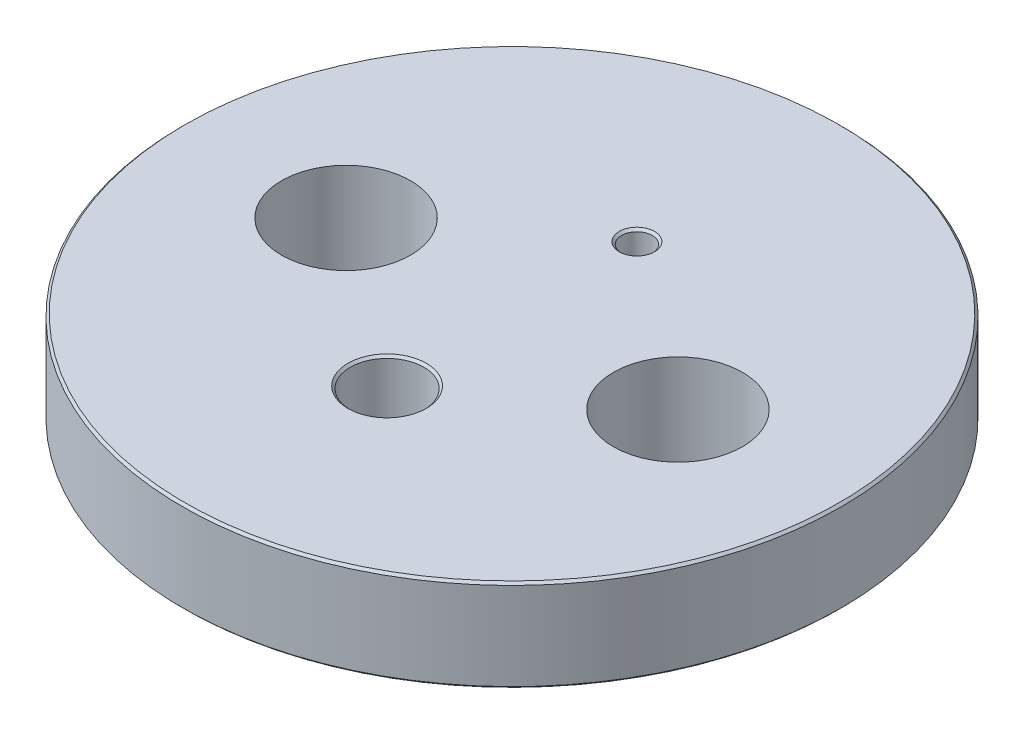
ISO-10303-21;
HEADER;
FILE_DESCRIPTION(('STEP AP214'),'2;1');
FILE_NAME('part.step','',(''),(''),'','','');
FILE_SCHEMA(('AUTOMOTIVE_DESIGN { 1 0 10303 214 1 1 1 1 }'));
ENDSEC;
DATA;
#1=APPLICATION_CONTEXT('core data for automotive mechanical design processes');
#2=APPLICATION_PROTOCOL_DEFINITION('international standard','automotive_design',2000,#1);
#3=PRODUCT_CONTEXT('',#1,'mechanical');
#4=PRODUCT('Part','Part','',(#3));
#5=PRODUCT_RELATED_PRODUCT_CATEGORY('part','',(#4));
#6=PRODUCT_DEFINITION_FORMATION('','',#4);
#7=PRODUCT_DEFINITION_CONTEXT('part definition',#1,'design');
#8=PRODUCT_DEFINITION('design','',#6,#7);
#9=PRODUCT_DEFINITION_SHAPE('','',#8);
#10=(LENGTH_UNIT() NAMED_UNIT(*) SI_UNIT(.MILLI.,.METRE.));
#11=(NAMED_UNIT(*) PLANE_ANGLE_UNIT() SI_UNIT($,.RADIAN.));
#12=(NAMED_UNIT(*) SI_UNIT($,.STERADIAN.) SOLID_ANGLE_UNIT());
#13=UNCERTAINTY_MEASURE_WITH_UNIT(LENGTH_MEASURE(1.E-05),#10,'distance_accuracy_value','');
#14=(GEOMETRIC_REPRESENTATION_CONTEXT(3) GLOBAL_UNCERTAINTY_ASSIGNED_CONTEXT((#13)) GLOBAL_UNIT_ASSIGNED_CONTEXT((#10,
#11,#12)) REPRESENTATION_CONTEXT('',''));
#15=CARTESIAN_POINT('',(0.,0.,0.));
#16=DIRECTION('',(0.,0.,1.));
#17=DIRECTION('',(1.,0.,0.));
#18=AXIS2_PLACEMENT_3D('',#15,#16,#17);
#19=CARTESIAN_POINT('',(0.,-32.5,13.55));
#20=DIRECTION('',(0.,1.,0.));
#21=DIRECTION('',(1.,0.,0.));
#22=AXIS2_PLACEMENT_3D('',#19,#20,#21);
#23=CYLINDRICAL_SURFACE('',#22,4.);
#24=CARTESIAN_POINT('',(0.,-22.75,13.55));
#25=DIRECTION('',(0.,-1.,0.));
#26=DIRECTION('',(1.,0.,0.));
#27=AXIS2_PLACEMENT_3D('',#24,#25,#26);
#28=CIRCLE('',#27,4.);
#29=CARTESIAN_POINT('',(4.,-22.75,13.55));
#30=VERTEX_POINT('',#29);
#31=EDGE_CURVE('E126',#30,#30,#28,.T.);
#32=ORIENTED_EDGE('',*,*,#31,.F.);
#33=DIRECTION('',(0.,1.,0.));
#34=VECTOR('',#33,1.);
#35=CARTESIAN_POINT('',(4.,-32.5,13.55));
#36=LINE('',#35,#34);
#37=CARTESIAN_POINT('',(4.,-32.25,13.55));
#38=VERTEX_POINT('',#37);
#39=EDGE_CURVE('E10',#38,#30,#36,.T.);
#40=ORIENTED_EDGE('',*,*,#39,.F.);
#41=CARTESIAN_POINT('',(0.,-32.25,13.55));
#42=DIRECTION('',(0.,1.,0.));
#43=DIRECTION('',(1.,0.,0.));
#44=AXIS2_PLACEMENT_3D('',#41,#42,#43);
#45=CIRCLE('',#44,4.);
#46=EDGE_CURVE('E175',#38,#38,#45,.T.);
#47=ORIENTED_EDGE('',*,*,#46,.F.);
#48=ORIENTED_EDGE('',*,*,#39,.T.);
#49=EDGE_LOOP('',(#32,#40,#47,#48));
#50=FACE_BOUND('',#49,.T.);
#51=ADVANCED_FACE('F16',(#50),#23,.F.);
#52=CARTESIAN_POINT('',(0.,-22.5,0.));
#53=DIRECTION('',(0.,-1.,0.));
#54=DIRECTION('',(-1.,0.,0.));
#55=AXIS2_PLACEMENT_3D('',#52,#53,#54);
#56=CYLINDRICAL_SURFACE('',#55,35.75);
#57=CARTESIAN_POINT('',(0.,-22.75,0.));
#58=DIRECTION('',(0.,1.,0.));
#59=DIRECTION('',(-1.,0.,0.));
#60=AXIS2_PLACEMENT_3D('',#57,#58,#59);
#61=CIRCLE('',#60,35.75);
#62=CARTESIAN_POINT('',(-35.75,-22.75,0.));
#63=VERTEX_POINT('',#62);
#64=EDGE_CURVE('E140',#63,#63,#61,.T.);
#65=ORIENTED_EDGE('',*,*,#64,.F.);
#66=DIRECTION('',(0.,-1.,0.));
#67=VECTOR('',#66,1.);
#68=CARTESIAN_POINT('',(-35.75,-22.5,0.));
#69=LINE('',#68,#67);
#70=CARTESIAN_POINT('',(-35.75,-32.25,0.));
#71=VERTEX_POINT('',#70);
#72=EDGE_CURVE('E24',#63,#71,#69,.T.);
#73=ORIENTED_EDGE('',*,*,#72,.T.);
#74=CARTESIAN_POINT('',(0.,-32.25,0.));
#75=DIRECTION('',(0.,-1.,0.));
#76=DIRECTION('',(-1.,0.,0.));
#77=AXIS2_PLACEMENT_3D('',#74,#75,#76);
#78=CIRCLE('',#77,35.75);
#79=EDGE_CURVE('E164',#71,#71,#78,.T.);
#80=ORIENTED_EDGE('',*,*,#79,.F.);
#81=ORIENTED_EDGE('',*,*,#72,.F.);
#82=EDGE_LOOP('',(#65,#73,#80,#81));
#83=FACE_BOUND('',#82,.T.);
#84=ADVANCED_FACE('F263',(#83),#56,.T.);
#85=CARTESIAN_POINT('',(0.,-32.375,13.55));
#86=DIRECTION('',(0.,-1.,0.));
#87=DIRECTION('',(1.,0.,0.));
#88=AXIS2_PLACEMENT_3D('',#85,#86,#87);
#89=CONICAL_SURFACE('',#88,4.125,0.785398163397);
#90=CARTESIAN_POINT('',(0.,-32.5,13.55));
#91=DIRECTION('',(0.,1.,0.));
#92=DIRECTION('',(1.,0.,0.));
#93=AXIS2_PLACEMENT_3D('',#90,#91,#92);
#94=CIRCLE('',#93,4.25);
#95=CARTESIAN_POINT('',(4.25,-32.5,13.55));
#96=VERTEX_POINT('',#95);
#97=EDGE_CURVE('E133',#96,#96,#94,.T.);
#98=ORIENTED_EDGE('',*,*,#97,.F.);
#99=DIRECTION('',(0.707106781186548,-0.707106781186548,0.));
#100=VECTOR('',#99,1.);
#101=CARTESIAN_POINT('',(4.125,-32.375,13.55));
#102=LINE('',#101,#100);
#103=EDGE_CURVE('E110',#38,#96,#102,.T.);
#104=ORIENTED_EDGE('',*,*,#103,.F.);
#105=ORIENTED_EDGE('',*,*,#46,.T.);
#106=ORIENTED_EDGE('',*,*,#103,.T.);
#107=EDGE_LOOP('',(#98,#104,#105,#106));
#108=FACE_BOUND('',#107,.T.);
#109=ADVANCED_FACE('F228',(#108),#89,.F.);
#110=CARTESIAN_POINT('',(0.,-32.375,0.));
#111=DIRECTION('',(0.,1.,0.));
#112=DIRECTION('',(-1.,0.,0.));
#113=AXIS2_PLACEMENT_3D('',#110,#111,#112);
#114=CONICAL_SURFACE('',#113,35.625,0.785398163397);
#115=CARTESIAN_POINT('',(0.,-32.5,0.));
#116=DIRECTION('',(0.,-1.,0.));
#117=DIRECTION('',(-1.,0.,0.));
#118=AXIS2_PLACEMENT_3D('',#115,#116,#117);
#119=CIRCLE('',#118,35.5);
#120=CARTESIAN_POINT('',(-35.5,-32.5,0.));
#121=VERTEX_POINT('',#120);
#122=EDGE_CURVE('E159',#121,#121,#119,.T.);
#123=ORIENTED_EDGE('',*,*,#122,.F.);
#124=DIRECTION('',(-0.707106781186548,0.707106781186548,0.));
#125=VECTOR('',#124,1.);
#126=CARTESIAN_POINT('',(-35.625,-32.375,0.));
#127=LINE('',#126,#125);
#128=EDGE_CURVE('E125',#121,#71,#127,.T.);
#129=ORIENTED_EDGE('',*,*,#128,.T.);
#130=ORIENTED_EDGE('',*,*,#79,.T.);
#131=ORIENTED_EDGE('',*,*,#128,.F.);
#132=EDGE_LOOP('',(#123,#129,#130,#131));
#133=FACE_BOUND('',#132,.T.);
#134=ADVANCED_FACE('F319',(#133),#114,.T.);
#135=CARTESIAN_POINT('',(18.,-32.6,0.));
#136=DIRECTION('',(0.,1.,0.));
#137=DIRECTION('',(0.,0.,1.));
#138=AXIS2_PLACEMENT_3D('',#135,#136,#137);
#139=CYLINDRICAL_SURFACE('',#138,7.);
#140=DIRECTION('',(0.,1.,0.));
#141=VECTOR('',#140,1.);
#142=CARTESIAN_POINT('',(18.,-32.6,7.));
#143=LINE('',#142,#141);
#144=CARTESIAN_POINT('',(18.,-32.5,7.));
#145=VERTEX_POINT('',#144);
#146=CARTESIAN_POINT('',(18.,-22.5,7.));
#147=VERTEX_POINT('',#146);
#148=EDGE_CURVE('E118',#145,#147,#143,.T.);
#149=ORIENTED_EDGE('',*,*,#148,.F.);
#150=CARTESIAN_POINT('',(18.,-32.5,0.));
#151=DIRECTION('',(0.,1.,0.));
#152=DIRECTION('',(0.,0.,1.));
#153=AXIS2_PLACEMENT_3D('',#150,#151,#152);
#154=CIRCLE('',#153,7.);
#155=EDGE_CURVE('E121',#145,#145,#154,.T.);
#156=ORIENTED_EDGE('',*,*,#155,.F.);
#157=ORIENTED_EDGE('',*,*,#148,.T.);
#158=CARTESIAN_POINT('',(18.,-22.5,0.));
#159=DIRECTION('',(0.,1.,0.));
#160=DIRECTION('',(0.,0.,1.));
#161=AXIS2_PLACEMENT_3D('',#158,#159,#160);
#162=CIRCLE('',#161,7.);
#163=EDGE_CURVE('E123',#147,#147,#162,.T.);
#164=ORIENTED_EDGE('',*,*,#163,.T.);
#165=EDGE_LOOP('',(#149,#156,#157,#164));
#166=FACE_BOUND('',#165,.T.);
#167=ADVANCED_FACE('F120',(#166),#139,.F.);
#168=CARTESIAN_POINT('',(0.,-22.625,13.55));
#169=DIRECTION('',(0.,1.,0.));
#170=DIRECTION('',(1.,0.,0.));
#171=AXIS2_PLACEMENT_3D('',#168,#169,#170);
#172=CONICAL_SURFACE('',#171,4.125,0.785398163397);
#173=CARTESIAN_POINT('',(0.,-22.5,13.55));
#174=DIRECTION('',(0.,-1.,0.));
#175=DIRECTION('',(1.,0.,0.));
#176=AXIS2_PLACEMENT_3D('',#173,#174,#175);
#177=CIRCLE('',#176,4.25);
#178=CARTESIAN_POINT('',(4.25,-22.5,13.55));
#179=VERTEX_POINT('',#178);
#180=EDGE_CURVE('E160',#179,#179,#177,.T.);
#181=ORIENTED_EDGE('',*,*,#180,.F.);
#182=DIRECTION('',(0.707106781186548,0.707106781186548,0.));
#183=VECTOR('',#182,1.);
#184=CARTESIAN_POINT('',(4.125,-22.625,13.55));
#185=LINE('',#184,#183);
#186=EDGE_CURVE('E210',#30,#179,#185,.T.);
#187=ORIENTED_EDGE('',*,*,#186,.F.);
#188=ORIENTED_EDGE('',*,*,#31,.T.);
#189=ORIENTED_EDGE('',*,*,#186,.T.);
#190=EDGE_LOOP('',(#181,#187,#188,#189));
#191=FACE_BOUND('',#190,.T.);
#192=ADVANCED_FACE('F226',(#191),#172,.F.);
#193=CARTESIAN_POINT('',(-18.,-32.6,0.));
#194=DIRECTION('',(0.,1.,0.));
#195=DIRECTION('',(0.,0.,1.));
#196=AXIS2_PLACEMENT_3D('',#193,#194,#195);
#197=CYLINDRICAL_SURFACE('',#196,7.);
#198=DIRECTION('',(0.,1.,0.));
#199=VECTOR('',#198,1.);
#200=CARTESIAN_POINT('',(-18.,-32.6,7.));
#201=LINE('',#200,#199);
#202=CARTESIAN_POINT('',(-18.,-32.5,7.));
#203=VERTEX_POINT('',#202);
#204=CARTESIAN_POINT('',(-18.,-22.5,7.));
#205=VERTEX_POINT('',#204);
#206=EDGE_CURVE('E147',#203,#205,#201,.T.);
#207=ORIENTED_EDGE('',*,*,#206,.F.);
#208=CARTESIAN_POINT('',(-18.,-32.5,0.));
#209=DIRECTION('',(0.,1.,0.));
#210=DIRECTION('',(0.,0.,1.));
#211=AXIS2_PLACEMENT_3D('',#208,#209,#210);
#212=CIRCLE('',#211,7.);
#213=EDGE_CURVE('E143',#203,#203,#212,.T.);
#214=ORIENTED_EDGE('',*,*,#213,.F.);
#215=ORIENTED_EDGE('',*,*,#206,.T.);
#216=CARTESIAN_POINT('',(-18.,-22.5,0.));
#217=DIRECTION('',(0.,1.,0.));
#218=DIRECTION('',(0.,0.,1.));
#219=AXIS2_PLACEMENT_3D('',#216,#217,#218);
#220=CIRCLE('',#219,7.);
#221=EDGE_CURVE('E155',#205,#205,#220,.T.);
#222=ORIENTED_EDGE('',*,*,#221,.T.);
#223=EDGE_LOOP('',(#207,#214,#215,#222));
#224=FACE_BOUND('',#223,.T.);
#225=ADVANCED_FACE('F285',(#224),#197,.F.);
#226=CARTESIAN_POINT('',(0.,-22.625,0.));
#227=DIRECTION('',(0.,-1.,0.));
#228=DIRECTION('',(-1.,0.,0.));
#229=AXIS2_PLACEMENT_3D('',#226,#227,#228);
#230=CONICAL_SURFACE('',#229,35.625,0.785398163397);
#231=CARTESIAN_POINT('',(0.,-22.5,0.));
#232=DIRECTION('',(0.,1.,0.));
#233=DIRECTION('',(-1.,0.,0.));
#234=AXIS2_PLACEMENT_3D('',#231,#232,#233);
#235=CIRCLE('',#234,35.5);
#236=CARTESIAN_POINT('',(-35.5,-22.5,0.));
#237=VERTEX_POINT('',#236);
#238=EDGE_CURVE('E151',#237,#237,#235,.T.);
#239=ORIENTED_EDGE('',*,*,#238,.F.);
#240=DIRECTION('',(-0.707106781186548,-0.707106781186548,0.));
#241=VECTOR('',#240,1.);
#242=CARTESIAN_POINT('',(-35.625,-22.625,0.));
#243=LINE('',#242,#241);
#244=EDGE_CURVE('E132',#237,#63,#243,.T.);
#245=ORIENTED_EDGE('',*,*,#244,.T.);
#246=ORIENTED_EDGE('',*,*,#64,.T.);
#247=ORIENTED_EDGE('',*,*,#244,.F.);
#248=EDGE_LOOP('',(#239,#245,#246,#247));
#249=FACE_BOUND('',#248,.T.);
#250=ADVANCED_FACE('F292',(#249),#230,.T.);
#251=CARTESIAN_POINT('',(0.,-32.5,0.));
#252=DIRECTION('',(0.,-1.,0.));
#253=DIRECTION('',(-1.,0.,0.));
#254=AXIS2_PLACEMENT_3D('',#251,#252,#253);
#255=PLANE('',#254);
#256=ORIENTED_EDGE('',*,*,#155,.T.);
#257=EDGE_LOOP('',(#256));
#258=FACE_BOUND('',#257,.T.);
#259=CARTESIAN_POINT('',(0.,-32.5,-13.55));
#260=DIRECTION('',(0.,-1.,0.));
#261=DIRECTION('',(1.,0.,0.));
#262=AXIS2_PLACEMENT_3D('',#259,#260,#261);
#263=CIRCLE('',#262,4.25);
#264=CARTESIAN_POINT('',(4.25,-32.5,-13.55));
#265=VERTEX_POINT('',#264);
#266=EDGE_CURVE('E156',#265,#265,#263,.T.);
#267=ORIENTED_EDGE('',*,*,#266,.F.);
#268=EDGE_LOOP('',(#267));
#269=FACE_BOUND('',#268,.T.);
#270=ORIENTED_EDGE('',*,*,#97,.T.);
#271=EDGE_LOOP('',(#270));
#272=FACE_BOUND('',#271,.T.);
#273=ORIENTED_EDGE('',*,*,#213,.T.);
#274=EDGE_LOOP('',(#273));
#275=FACE_BOUND('',#274,.T.);
#276=ORIENTED_EDGE('',*,*,#122,.T.);
#277=EDGE_LOOP('',(#276));
#278=FACE_BOUND('',#277,.T.);
#279=ADVANCED_FACE('F129',(#258,#269,#272,#275,#278),#255,.T.);
#280=CARTESIAN_POINT('',(0.,-22.5,0.));
#281=DIRECTION('',(0.,-1.,0.));
#282=DIRECTION('',(-1.,0.,0.));
#283=AXIS2_PLACEMENT_3D('',#280,#281,#282);
#284=PLANE('',#283);
#285=ORIENTED_EDGE('',*,*,#163,.F.);
#286=EDGE_LOOP('',(#285));
#287=FACE_BOUND('',#286,.T.);
#288=CARTESIAN_POINT('',(0.,-22.5,-13.55));
#289=DIRECTION('',(0.,1.,0.));
#290=DIRECTION('',(1.,0.,0.));
#291=AXIS2_PLACEMENT_3D('',#288,#289,#290);
#292=CIRCLE('',#291,1.916);
#293=CARTESIAN_POINT('',(1.916,-22.5,-13.55));
#294=VERTEX_POINT('',#293);
#295=EDGE_CURVE('E173',#294,#294,#292,.T.);
#296=ORIENTED_EDGE('',*,*,#295,.F.);
#297=EDGE_LOOP('',(#296));
#298=FACE_BOUND('',#297,.T.);
#299=ORIENTED_EDGE('',*,*,#180,.T.);
#300=EDGE_LOOP('',(#299));
#301=FACE_BOUND('',#300,.T.);
#302=ORIENTED_EDGE('',*,*,#221,.F.);
#303=EDGE_LOOP('',(#302));
#304=FACE_BOUND('',#303,.T.);
#305=ORIENTED_EDGE('',*,*,#238,.T.);
#306=EDGE_LOOP('',(#305));
#307=FACE_BOUND('',#306,.T.);
#308=ADVANCED_FACE('F253',(#287,#298,#301,#304,#307),#284,.F.);
#309=CARTESIAN_POINT('',(0.,-32.375,-13.55));
#310=DIRECTION('',(0.,-1.,0.));
#311=DIRECTION('',(1.,0.,0.));
#312=AXIS2_PLACEMENT_3D('',#309,#310,#311);
#313=CONICAL_SURFACE('',#312,4.125,0.785398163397);
#314=DIRECTION('',(0.707106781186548,-0.707106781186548,0.));
#315=VECTOR('',#314,1.);
#316=CARTESIAN_POINT('',(4.125,-32.375,-13.55));
#317=LINE('',#316,#315);
#318=CARTESIAN_POINT('',(4.,-32.25,-13.55));
#319=VERTEX_POINT('',#318);
#320=EDGE_CURVE('E170',#319,#265,#317,.T.);
#321=ORIENTED_EDGE('',*,*,#320,.F.);
#322=CARTESIAN_POINT('',(0.,-32.25,-13.55));
#323=DIRECTION('',(0.,-1.,0.));
#324=DIRECTION('',(1.,0.,0.));
#325=AXIS2_PLACEMENT_3D('',#322,#323,#324);
#326=CIRCLE('',#325,4.);
#327=EDGE_CURVE('E190',#319,#319,#326,.T.);
#328=ORIENTED_EDGE('',*,*,#327,.F.);
#329=ORIENTED_EDGE('',*,*,#320,.T.);
#330=ORIENTED_EDGE('',*,*,#266,.T.);
#331=EDGE_LOOP('',(#321,#328,#329,#330));
#332=FACE_BOUND('',#331,.T.);
#333=ADVANCED_FACE('F269',(#332),#313,.F.);
#334=CARTESIAN_POINT('',(0.,-22.625,-13.55));
#335=DIRECTION('',(0.,1.,0.));
#336=DIRECTION('',(1.,0.,0.));
#337=AXIS2_PLACEMENT_3D('',#334,#335,#336);
#338=CONICAL_SURFACE('',#337,1.791,0.785398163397);
#339=DIRECTION('',(0.707106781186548,0.707106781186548,0.));
#340=VECTOR('',#339,1.);
#341=CARTESIAN_POINT('',(1.791,-22.625,-13.55));
#342=LINE('',#341,#340);
#343=CARTESIAN_POINT('',(1.666,-22.75,-13.55));
#344=VERTEX_POINT('',#343);
#345=EDGE_CURVE('E193',#344,#294,#342,.T.);
#346=ORIENTED_EDGE('',*,*,#345,.F.);
#347=CARTESIAN_POINT('',(0.,-22.75,-13.55));
#348=DIRECTION('',(0.,1.,0.));
#349=DIRECTION('',(1.,0.,0.));
#350=AXIS2_PLACEMENT_3D('',#347,#348,#349);
#351=CIRCLE('',#350,1.666);
#352=EDGE_CURVE('E219',#344,#344,#351,.T.);
#353=ORIENTED_EDGE('',*,*,#352,.F.);
#354=ORIENTED_EDGE('',*,*,#345,.T.);
#355=ORIENTED_EDGE('',*,*,#295,.T.);
#356=EDGE_LOOP('',(#346,#353,#354,#355));
#357=FACE_BOUND('',#356,.T.);
#358=ADVANCED_FACE('F274',(#357),#338,.F.);
#359=CARTESIAN_POINT('',(0.,-32.5,-13.55));
#360=DIRECTION('',(0.,1.,0.));
#361=DIRECTION('',(1.,0.,0.));
#362=AXIS2_PLACEMENT_3D('',#359,#360,#361);
#363=CYLINDRICAL_SURFACE('',#362,4.);
#364=CARTESIAN_POINT('',(0.,-26.5,-13.55));
#365=DIRECTION('',(0.,-1.,0.));
#366=DIRECTION('',(1.,0.,0.));
#367=AXIS2_PLACEMENT_3D('',#364,#365,#366);
#368=CIRCLE('',#367,4.);
#369=CARTESIAN_POINT('',(4.,-26.5,-13.55));
#370=VERTEX_POINT('',#369);
#371=EDGE_CURVE('E189',#370,#370,#368,.T.);
#372=ORIENTED_EDGE('',*,*,#371,.F.);
#373=DIRECTION('',(0.,1.,0.));
#374=VECTOR('',#373,1.);
#375=CARTESIAN_POINT('',(4.,-32.5,-13.55));
#376=LINE('',#375,#374);
#377=EDGE_CURVE('E194',#319,#370,#376,.T.);
#378=ORIENTED_EDGE('',*,*,#377,.F.);
#379=ORIENTED_EDGE('',*,*,#327,.T.);
#380=ORIENTED_EDGE('',*,*,#377,.T.);
#381=EDGE_LOOP('',(#372,#378,#379,#380));
#382=FACE_BOUND('',#381,.T.);
#383=ADVANCED_FACE('F366',(#382),#363,.F.);
#384=CARTESIAN_POINT('',(0.,-32.5,-13.55));
#385=DIRECTION('',(0.,1.,0.));
#386=DIRECTION('',(1.,0.,0.));
#387=AXIS2_PLACEMENT_3D('',#384,#385,#386);
#388=CYLINDRICAL_SURFACE('',#387,1.666);
#389=DIRECTION('',(0.,1.,0.));
#390=VECTOR('',#389,1.);
#391=CARTESIAN_POINT('',(1.666,-32.5,-13.55));
#392=LINE('',#391,#390);
#393=CARTESIAN_POINT('',(1.666,-26.25,-13.55));
#394=VERTEX_POINT('',#393);
#395=EDGE_CURVE('E208',#394,#344,#392,.T.);
#396=ORIENTED_EDGE('',*,*,#395,.F.);
#397=CARTESIAN_POINT('',(0.,-26.25,-13.55));
#398=DIRECTION('',(0.,1.,0.));
#399=DIRECTION('',(1.,0.,0.));
#400=AXIS2_PLACEMENT_3D('',#397,#398,#399);
#401=CIRCLE('',#400,1.666);
#402=EDGE_CURVE('E169',#394,#394,#401,.T.);
#403=ORIENTED_EDGE('',*,*,#402,.F.);
#404=ORIENTED_EDGE('',*,*,#395,.T.);
#405=ORIENTED_EDGE('',*,*,#352,.T.);
#406=EDGE_LOOP('',(#396,#403,#404,#405));
#407=FACE_BOUND('',#406,.T.);
#408=ADVANCED_FACE('F343',(#407),#388,.F.);
#409=CARTESIAN_POINT('',(0.,-26.5,-13.55));
#410=DIRECTION('',(0.,-1.,0.));
#411=DIRECTION('',(-1.,0.,0.));
#412=AXIS2_PLACEMENT_3D('',#409,#410,#411);
#413=PLANE('',#412);
#414=ORIENTED_EDGE('',*,*,#371,.T.);
#415=EDGE_LOOP('',(#414));
#416=FACE_BOUND('',#415,.T.);
#417=CARTESIAN_POINT('',(0.,-26.5,-13.55));
#418=DIRECTION('',(0.,-1.,0.));
#419=DIRECTION('',(1.,0.,0.));
#420=AXIS2_PLACEMENT_3D('',#417,#418,#419);
#421=CIRCLE('',#420,1.916);
#422=CARTESIAN_POINT('',(1.916,-26.5,-13.55));
#423=VERTEX_POINT('',#422);
#424=EDGE_CURVE('E186',#423,#423,#421,.T.);
#425=ORIENTED_EDGE('',*,*,#424,.F.);
#426=EDGE_LOOP('',(#425));
#427=FACE_BOUND('',#426,.T.);
#428=ADVANCED_FACE('F308',(#416,#427),#413,.T.);
#429=CARTESIAN_POINT('',(0.,-26.375,-13.55));
#430=DIRECTION('',(0.,-1.,0.));
#431=DIRECTION('',(1.,0.,0.));
#432=AXIS2_PLACEMENT_3D('',#429,#430,#431);
#433=CONICAL_SURFACE('',#432,1.791,0.785398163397);
#434=DIRECTION('',(0.707106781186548,-0.707106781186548,0.));
#435=VECTOR('',#434,1.);
#436=CARTESIAN_POINT('',(1.791,-26.375,-13.55));
#437=LINE('',#436,#435);
#438=EDGE_CURVE('E165',#394,#423,#437,.T.);
#439=ORIENTED_EDGE('',*,*,#438,.F.);
#440=ORIENTED_EDGE('',*,*,#402,.T.);
#441=ORIENTED_EDGE('',*,*,#438,.T.);
#442=ORIENTED_EDGE('',*,*,#424,.T.);
#443=EDGE_LOOP('',(#439,#440,#441,#442));
#444=FACE_BOUND('',#443,.T.);
#445=ADVANCED_FACE('F303',(#444),#433,.F.);
#446=CLOSED_SHELL('',(#51,#84,#109,#134,#167,#192,#225,#250,#279,#308,#333,#358,#383,#408,#428,#445));
#447=MANIFOLD_SOLID_BREP('B1',#446);
#448=ADVANCED_BREP_SHAPE_REPRESENTATION('',(#18,#447),#14);
#449=SHAPE_DEFINITION_REPRESENTATION(#9,#448);
ENDSEC;
END-ISO-10303-21;
